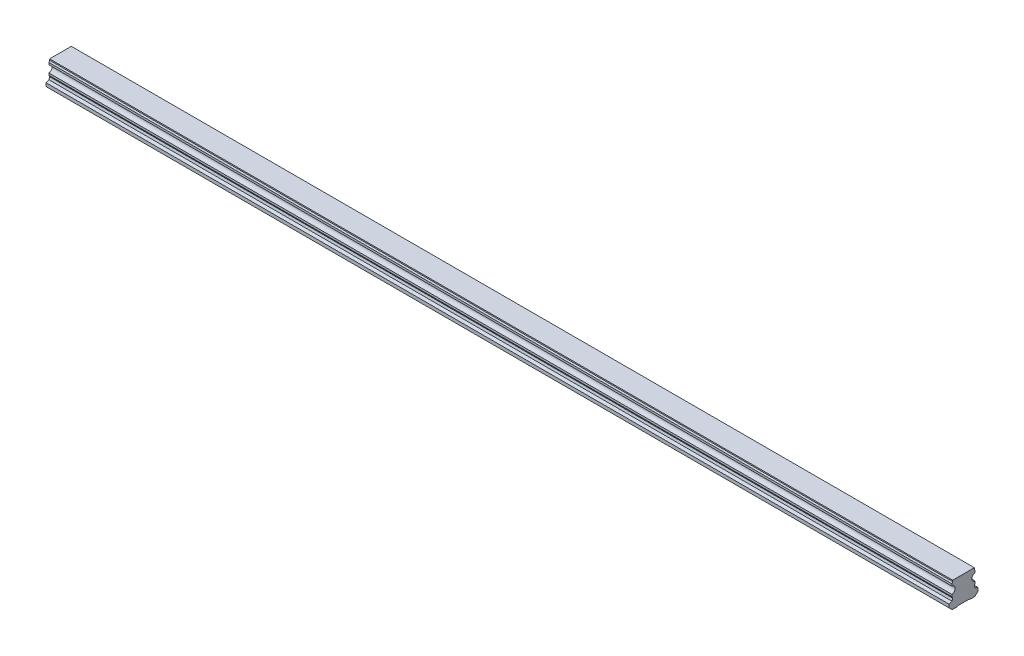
from build123d import *

# Parameters (mm, degrees)
BOSS_EXTRUDE1_DEPTH        = 780
SKETCH3_R                  = 3
SKETCH3_R_2                = 2.5
CUT_EXTRUDE3_DEPTH         = 12
SKETCH3_2_R                = 2.5
CUT_EXTRUDE4_DEPTH         = 15
CHAMFER1_SIZE              = 0.5
LPATTERN4_COUNT            = 13
LPATTERN4_PITCH            = 60
CHAMFER1_OF_LPATTERN4_SIZE = 0.5


with BuildPart() as part:
    # Sketch1 → Boss-Extrude1 (new body)
    with BuildSketch(Plane(origin=(0, 0, 0), x_dir=(0, 0, -1), z_dir=(1, 0, 0))):
        with BuildLine():
            Line((9.375, 21.8), (-9.375, 21.8))
            Line((-9.375, 21.8), (-9.375, 20.756))
            Line((-9.375, 20.756), (-10, 19.415683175))
            Line((-10, 19.415683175), (-10, 17.685449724))
            ThreePointArc((-10, 17.685449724), (-7.2, 14.6), (-10, 11.514550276))
            Line((-10, 11.514550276), (-10, 9.784316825))
            Line((-10, 9.784316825), (-9.375, 8.444))
            Line((-9.375, 8.444), (-9.922688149, 6.4))
            Line((-9.922688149, 6.4), (-12.5, 5.489338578))
            Line((-12.5, 5.489338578), (-12.5, 2.65))
            Line((-12.5, 2.65), (-9.85, 0))
            Line((-9.85, 0), (-5.5, 0))
            Line((-5.5, 0), (-5, 0.5))
            Line((-5, 0.5), (5, 0.5))
            Line((5, 0.5), (5.5, 0))
            Line((5.5, 0), (9.85, 0))
            Line((9.85, 0), (12.5, 2.65))
            Line((12.5, 2.65), (12.5, 5.489338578))
            Line((12.5, 5.489338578), (9.922688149, 6.4))
            Line((9.922688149, 6.4), (9.375, 8.444))
            Line((9.375, 8.444), (10, 9.784316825))
            Line((10, 9.784316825), (10, 11.514550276))
            ThreePointArc((10, 11.514550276), (7.2, 14.6), (10, 17.685449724))
            Line((10, 17.685449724), (10, 19.415683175))
            Line((10, 19.415683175), (9.375, 20.756))
            Line((9.375, 20.756), (9.375, 21.8))
        make_face()
    extrude(amount=BOSS_EXTRUDE1_DEPTH)

    # Sketch3 → Cut-Extrude3 (cut)
    with BuildSketch(Plane.XZ):
        with Locations(Location((30, 0, 0), (0, 0, 270))):
            Circle(SKETCH3_R)
        with Locations(Location((30, 0, 0), (0, 0, 270))):
            Circle(SKETCH3_R_2, mode=Mode.SUBTRACT)
    cut_extrude3 = extrude(amount=-CUT_EXTRUDE3_DEPTH, mode=Mode.SUBTRACT)

    # Sketch3_2 → Cut-Extrude4 (cut)
    with BuildSketch(Plane.XZ):
        with Locations(Location((30, 0, 0), (0, 0, 270))):
            Circle(SKETCH3_2_R)
    cut_extrude4 = extrude(amount=-CUT_EXTRUDE4_DEPTH, mode=Mode.SUBTRACT)

    # Cut-Extrude5 cone 1 section (on through the dimple's axis) → Cut-Extrude5 (revolve, cut)
    with BuildSketch(Plane(origin=(30, 15, 0), x_dir=(0, 0, -1), z_dir=(1, 0, 0))):
        Polygon((0, 0), (2.5, 0), (0, 1.443375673), align=None)
    cut_extrude5 = revolve(axis=Axis((30, 15, 0), (0, 1, 0)), mode=Mode.SUBTRACT)

    # Chamfer1
    chamfer1_edges = [part.edges().sort_by_distance(p)[0] for p in [
        (30, 0.5, 3),
    ]]
    chamfer(chamfer1_edges, length=CHAMFER1_SIZE)

    # LPattern4: Cut-Extrude3, Cut-Extrude4, Cut-Extrude5 ×13
    with Locations(*[(i * LPATTERN4_PITCH, 0, 0) for i in range(1, LPATTERN4_COUNT)]):
        add(cut_extrude3, mode=Mode.SUBTRACT)
        add(cut_extrude4, mode=Mode.SUBTRACT)
        add(cut_extrude5, mode=Mode.SUBTRACT)

    # Chamfer1 of LPattern4
    chamfer1_of_lpattern4_edges = [part.edges().sort_by_distance(p)[0] for p in [
        (90, 0.5, 3),
        (150, 0.5, 3),
        (210, 0.5, 3),
        (270, 0.5, 3),
        (330, 0.5, 3),
        (390, 0.5, 3),
        (450, 0.5, 3),
        (510, 0.5, 3),
        (570, 0.5, 3),
        (630, 0.5, 3),
        (690, 0.5, 3),
        (750, 0.5, 3),
    ]]
    chamfer(chamfer1_of_lpattern4_edges, length=CHAMFER1_OF_LPATTERN4_SIZE)


solid = part.part
